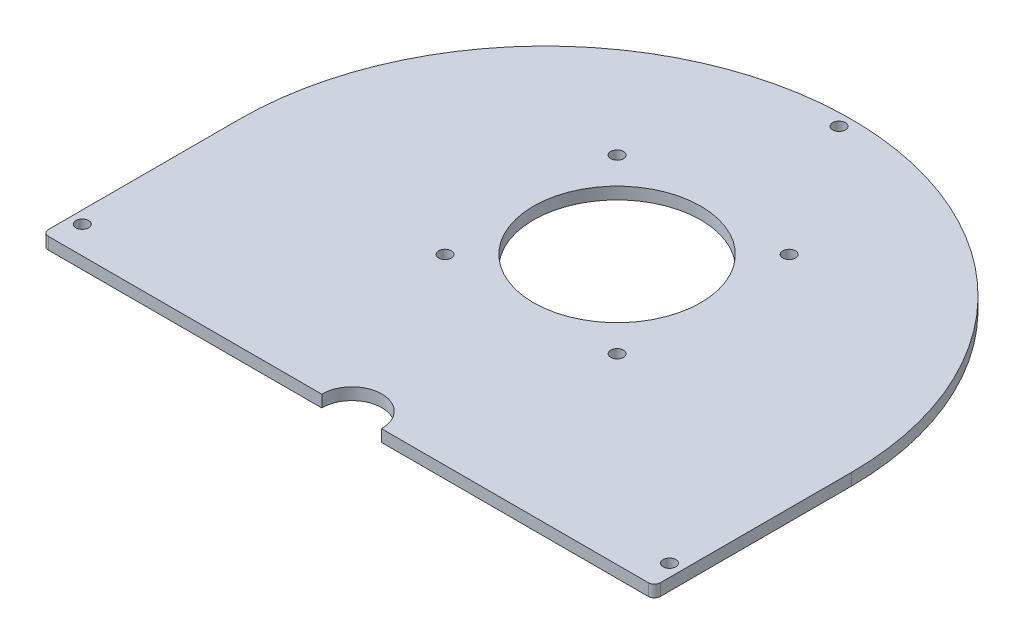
ISO-10303-21;
HEADER;
FILE_DESCRIPTION(('STEP AP214'),'2;1');
FILE_NAME('part.step','',(''),(''),'','','');
FILE_SCHEMA(('AUTOMOTIVE_DESIGN { 1 0 10303 214 1 1 1 1 }'));
ENDSEC;
DATA;
#1=APPLICATION_CONTEXT('core data for automotive mechanical design processes');
#2=APPLICATION_PROTOCOL_DEFINITION('international standard','automotive_design',2000,#1);
#3=PRODUCT_CONTEXT('',#1,'mechanical');
#4=PRODUCT('Part','Part','',(#3));
#5=PRODUCT_RELATED_PRODUCT_CATEGORY('part','',(#4));
#6=PRODUCT_DEFINITION_FORMATION('','',#4);
#7=PRODUCT_DEFINITION_CONTEXT('part definition',#1,'design');
#8=PRODUCT_DEFINITION('design','',#6,#7);
#9=PRODUCT_DEFINITION_SHAPE('','',#8);
#10=(LENGTH_UNIT() NAMED_UNIT(*) SI_UNIT(.MILLI.,.METRE.));
#11=(NAMED_UNIT(*) PLANE_ANGLE_UNIT() SI_UNIT($,.RADIAN.));
#12=(NAMED_UNIT(*) SI_UNIT($,.STERADIAN.) SOLID_ANGLE_UNIT());
#13=UNCERTAINTY_MEASURE_WITH_UNIT(LENGTH_MEASURE(1.E-05),#10,'distance_accuracy_value','');
#14=(GEOMETRIC_REPRESENTATION_CONTEXT(3) GLOBAL_UNCERTAINTY_ASSIGNED_CONTEXT((#13)) GLOBAL_UNIT_ASSIGNED_CONTEXT((#10,
#11,#12)) REPRESENTATION_CONTEXT('',''));
#15=CARTESIAN_POINT('',(0.,0.,0.));
#16=DIRECTION('',(0.,0.,1.));
#17=DIRECTION('',(1.,0.,0.));
#18=AXIS2_PLACEMENT_3D('',#15,#16,#17);
#19=CARTESIAN_POINT('',(-162.56,6.35,104.6734));
#20=DIRECTION('',(0.,0.,-1.));
#21=DIRECTION('',(-1.,0.,0.));
#22=AXIS2_PLACEMENT_3D('',#19,#20,#21);
#23=PLANE('',#22);
#24=DIRECTION('',(1.,0.,0.));
#25=VECTOR('',#24,1.);
#26=CARTESIAN_POINT('',(-162.56,0.,104.6734));
#27=LINE('',#26,#25);
#28=CARTESIAN_POINT('',(-159.385,0.,104.6734));
#29=VERTEX_POINT('',#28);
#30=CARTESIAN_POINT('',(-14.1612601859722,0.,104.6734));
#31=VERTEX_POINT('',#30);
#32=EDGE_CURVE('E118',#29,#31,#27,.T.);
#33=ORIENTED_EDGE('',*,*,#32,.T.);
#34=DIRECTION('',(0.,1.,0.));
#35=VECTOR('',#34,1.);
#36=CARTESIAN_POINT('',(-14.1612601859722,0.,104.6734));
#37=LINE('',#36,#35);
#38=CARTESIAN_POINT('',(-14.1612601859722,6.35,104.6734));
#39=VERTEX_POINT('',#38);
#40=EDGE_CURVE('E48',#31,#39,#37,.T.);
#41=ORIENTED_EDGE('',*,*,#40,.T.);
#42=DIRECTION('',(1.,0.,0.));
#43=VECTOR('',#42,1.);
#44=CARTESIAN_POINT('',(-162.56,6.35,104.6734));
#45=LINE('',#44,#43);
#46=CARTESIAN_POINT('',(-159.385,6.35,104.6734));
#47=VERTEX_POINT('',#46);
#48=EDGE_CURVE('E161',#47,#39,#45,.T.);
#49=ORIENTED_EDGE('',*,*,#48,.F.);
#50=DIRECTION('',(0.,-1.,0.));
#51=VECTOR('',#50,1.);
#52=CARTESIAN_POINT('',(-159.385,6.35,104.6734));
#53=LINE('',#52,#51);
#54=EDGE_CURVE('E143',#47,#29,#53,.T.);
#55=ORIENTED_EDGE('',*,*,#54,.T.);
#56=EDGE_LOOP('',(#33,#41,#49,#55));
#57=FACE_BOUND('',#56,.T.);
#58=ADVANCED_FACE('F33',(#57),#23,.F.);
#59=CARTESIAN_POINT('',(-162.56,6.35,104.6734));
#60=DIRECTION('',(1.,0.,0.));
#61=DIRECTION('',(0.,0.,-1.));
#62=AXIS2_PLACEMENT_3D('',#59,#60,#61);
#63=PLANE('',#62);
#64=DIRECTION('',(0.,0.,1.));
#65=VECTOR('',#64,1.);
#66=CARTESIAN_POINT('',(-162.56,0.,104.6734));
#67=LINE('',#66,#65);
#68=CARTESIAN_POINT('',(-162.56,0.,0.));
#69=VERTEX_POINT('',#68);
#70=CARTESIAN_POINT('',(-162.56,0.,101.4984));
#71=VERTEX_POINT('',#70);
#72=EDGE_CURVE('E119',#69,#71,#67,.T.);
#73=ORIENTED_EDGE('',*,*,#72,.T.);
#74=DIRECTION('',(0.,-1.,0.));
#75=VECTOR('',#74,1.);
#76=CARTESIAN_POINT('',(-162.56,6.35,101.4984));
#77=LINE('',#76,#75);
#78=CARTESIAN_POINT('',(-162.56,6.35,101.4984));
#79=VERTEX_POINT('',#78);
#80=EDGE_CURVE('E11',#71,#79,#77,.F.);
#81=ORIENTED_EDGE('',*,*,#80,.T.);
#82=DIRECTION('',(0.,0.,1.));
#83=VECTOR('',#82,1.);
#84=CARTESIAN_POINT('',(-162.56,6.35,104.6734));
#85=LINE('',#84,#83);
#86=CARTESIAN_POINT('',(-162.56,6.35,0.));
#87=VERTEX_POINT('',#86);
#88=EDGE_CURVE('E129',#87,#79,#85,.T.);
#89=ORIENTED_EDGE('',*,*,#88,.F.);
#90=DIRECTION('',(0.,-1.,0.));
#91=VECTOR('',#90,1.);
#92=CARTESIAN_POINT('',(-162.56,6.35,0.));
#93=LINE('',#92,#91);
#94=EDGE_CURVE('E130',#87,#69,#93,.T.);
#95=ORIENTED_EDGE('',*,*,#94,.T.);
#96=EDGE_LOOP('',(#73,#81,#89,#95));
#97=FACE_BOUND('',#96,.T.);
#98=ADVANCED_FACE('F177',(#97),#63,.F.);
#99=CARTESIAN_POINT('',(17.5862601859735,6.35,104.6734));
#100=VERTEX_POINT('',#99);
#101=CARTESIAN_POINT('',(159.385,6.35,104.6734));
#102=VERTEX_POINT('',#101);
#103=EDGE_CURVE('E112',#100,#102,#45,.T.);
#104=ORIENTED_EDGE('',*,*,#103,.F.);
#105=DIRECTION('',(0.,1.,0.));
#106=VECTOR('',#105,1.);
#107=CARTESIAN_POINT('',(17.5862601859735,0.,104.6734));
#108=LINE('',#107,#106);
#109=CARTESIAN_POINT('',(17.5862601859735,0.,104.6734));
#110=VERTEX_POINT('',#109);
#111=EDGE_CURVE('E98',#100,#110,#108,.F.);
#112=ORIENTED_EDGE('',*,*,#111,.T.);
#113=CARTESIAN_POINT('',(159.385,0.,104.6734));
#114=VERTEX_POINT('',#113);
#115=EDGE_CURVE('E110',#110,#114,#27,.T.);
#116=ORIENTED_EDGE('',*,*,#115,.T.);
#117=DIRECTION('',(0.,-1.,0.));
#118=VECTOR('',#117,1.);
#119=CARTESIAN_POINT('',(159.385,6.35,104.6734));
#120=LINE('',#119,#118);
#121=EDGE_CURVE('E146',#114,#102,#120,.F.);
#122=ORIENTED_EDGE('',*,*,#121,.T.);
#123=EDGE_LOOP('',(#104,#112,#116,#122));
#124=FACE_BOUND('',#123,.T.);
#125=ADVANCED_FACE('F108',(#124),#23,.F.);
#126=CARTESIAN_POINT('',(162.56,6.35,104.6734));
#127=DIRECTION('',(-1.,0.,0.));
#128=DIRECTION('',(0.,0.,1.));
#129=AXIS2_PLACEMENT_3D('',#126,#127,#128);
#130=PLANE('',#129);
#131=DIRECTION('',(0.,0.,-1.));
#132=VECTOR('',#131,1.);
#133=CARTESIAN_POINT('',(162.56,6.35,104.6734));
#134=LINE('',#133,#132);
#135=CARTESIAN_POINT('',(162.56,6.35,101.4984));
#136=VERTEX_POINT('',#135);
#137=CARTESIAN_POINT('',(162.56,6.35,0.));
#138=VERTEX_POINT('',#137);
#139=EDGE_CURVE('E154',#136,#138,#134,.T.);
#140=ORIENTED_EDGE('',*,*,#139,.F.);
#141=DIRECTION('',(0.,-1.,0.));
#142=VECTOR('',#141,1.);
#143=CARTESIAN_POINT('',(162.56,6.35,101.4984));
#144=LINE('',#143,#142);
#145=CARTESIAN_POINT('',(162.56,0.,101.4984));
#146=VERTEX_POINT('',#145);
#147=EDGE_CURVE('E137',#136,#146,#144,.T.);
#148=ORIENTED_EDGE('',*,*,#147,.T.);
#149=DIRECTION('',(0.,0.,-1.));
#150=VECTOR('',#149,1.);
#151=CARTESIAN_POINT('',(162.56,0.,104.6734));
#152=LINE('',#151,#150);
#153=CARTESIAN_POINT('',(162.56,0.,0.));
#154=VERTEX_POINT('',#153);
#155=EDGE_CURVE('E121',#146,#154,#152,.T.);
#156=ORIENTED_EDGE('',*,*,#155,.T.);
#157=DIRECTION('',(0.,-1.,0.));
#158=VECTOR('',#157,1.);
#159=CARTESIAN_POINT('',(162.56,6.35,0.));
#160=LINE('',#159,#158);
#161=EDGE_CURVE('E133',#138,#154,#160,.T.);
#162=ORIENTED_EDGE('',*,*,#161,.F.);
#163=EDGE_LOOP('',(#140,#148,#156,#162));
#164=FACE_BOUND('',#163,.T.);
#165=ADVANCED_FACE('F159',(#164),#130,.F.);
#166=CARTESIAN_POINT('',(0.,6.35,0.));
#167=DIRECTION('',(0.,-1.,0.));
#168=DIRECTION('',(0.,0.,-1.));
#169=AXIS2_PLACEMENT_3D('',#166,#167,#168);
#170=CYLINDRICAL_SURFACE('',#169,162.56);
#171=CARTESIAN_POINT('',(0.,0.,0.));
#172=DIRECTION('',(0.,1.,0.));
#173=DIRECTION('',(0.,0.,1.));
#174=AXIS2_PLACEMENT_3D('',#171,#172,#173);
#175=CIRCLE('',#174,162.56);
#176=EDGE_CURVE('E127',#154,#69,#175,.T.);
#177=ORIENTED_EDGE('',*,*,#176,.T.);
#178=ORIENTED_EDGE('',*,*,#94,.F.);
#179=CARTESIAN_POINT('',(0.,6.35,0.));
#180=DIRECTION('',(0.,1.,0.));
#181=DIRECTION('',(0.,0.,1.));
#182=AXIS2_PLACEMENT_3D('',#179,#180,#181);
#183=CIRCLE('',#182,162.56);
#184=EDGE_CURVE('E134',#138,#87,#183,.T.);
#185=ORIENTED_EDGE('',*,*,#184,.F.);
#186=ORIENTED_EDGE('',*,*,#161,.T.);
#187=EDGE_LOOP('',(#177,#178,#185,#186));
#188=FACE_BOUND('',#187,.T.);
#189=ADVANCED_FACE('F188',(#188),#170,.T.);
#190=CARTESIAN_POINT('',(0.,6.35,0.));
#191=DIRECTION('',(0.,1.,0.));
#192=DIRECTION('',(0.,0.,1.));
#193=AXIS2_PLACEMENT_3D('',#190,#191,#192);
#194=PLANE('',#193);
#195=CARTESIAN_POINT('',(1.71250000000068,6.35,104.474999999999));
#196=DIRECTION('',(0.,1.,0.));
#197=DIRECTION('',(0.,0.,1.));
#198=AXIS2_PLACEMENT_3D('',#195,#196,#197);
#199=CIRCLE('',#198,15.875000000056);
#200=EDGE_CURVE('E104',#100,#39,#199,.T.);
#201=ORIENTED_EDGE('',*,*,#200,.F.);
#202=ORIENTED_EDGE('',*,*,#103,.T.);
#203=CARTESIAN_POINT('',(159.385,6.35,101.4984));
#204=DIRECTION('',(0.,1.,0.));
#205=DIRECTION('',(0.,0.,1.));
#206=AXIS2_PLACEMENT_3D('',#203,#204,#205);
#207=CIRCLE('',#206,3.175);
#208=EDGE_CURVE('E41',#102,#136,#207,.T.);
#209=ORIENTED_EDGE('',*,*,#208,.T.);
#210=ORIENTED_EDGE('',*,*,#139,.T.);
#211=ORIENTED_EDGE('',*,*,#184,.T.);
#212=ORIENTED_EDGE('',*,*,#88,.T.);
#213=CARTESIAN_POINT('',(-159.385,6.35,101.4984));
#214=DIRECTION('',(0.,1.,0.));
#215=DIRECTION('',(0.,0.,1.));
#216=AXIS2_PLACEMENT_3D('',#213,#214,#215);
#217=CIRCLE('',#216,3.175);
#218=EDGE_CURVE('E148',#79,#47,#217,.T.);
#219=ORIENTED_EDGE('',*,*,#218,.T.);
#220=ORIENTED_EDGE('',*,*,#48,.T.);
#221=EDGE_LOOP('',(#201,#202,#209,#210,#211,#212,#219,#220));
#222=FACE_BOUND('',#221,.T.);
#223=CARTESIAN_POINT('',(45.72,6.35,-83.82));
#224=DIRECTION('',(0.,-1.,0.));
#225=DIRECTION('',(0.,0.,-1.));
#226=AXIS2_PLACEMENT_3D('',#223,#224,#225);
#227=CIRCLE('',#226,3.3782);
#228=CARTESIAN_POINT('',(45.72,6.35,-87.1982));
#229=VERTEX_POINT('',#228);
#230=EDGE_CURVE('E330',#229,#229,#227,.T.);
#231=ORIENTED_EDGE('',*,*,#230,.T.);
#232=EDGE_LOOP('',(#231));
#233=FACE_BOUND('',#232,.T.);
#234=CARTESIAN_POINT('',(-45.72,6.35,-83.82));
#235=DIRECTION('',(0.,-1.,0.));
#236=DIRECTION('',(0.,0.,-1.));
#237=AXIS2_PLACEMENT_3D('',#234,#235,#236);
#238=CIRCLE('',#237,3.3782);
#239=CARTESIAN_POINT('',(-45.72,6.35,-87.1982));
#240=VERTEX_POINT('',#239);
#241=EDGE_CURVE('E341',#240,#240,#238,.T.);
#242=ORIENTED_EDGE('',*,*,#241,.T.);
#243=EDGE_LOOP('',(#242));
#244=FACE_BOUND('',#243,.T.);
#245=CARTESIAN_POINT('',(-45.72,6.35,7.61999999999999));
#246=DIRECTION('',(0.,-1.,0.));
#247=DIRECTION('',(0.,0.,-1.));
#248=AXIS2_PLACEMENT_3D('',#245,#246,#247);
#249=CIRCLE('',#248,3.3782);
#250=CARTESIAN_POINT('',(-45.72,6.35,4.2418));
#251=VERTEX_POINT('',#250);
#252=EDGE_CURVE('E347',#251,#251,#249,.T.);
#253=ORIENTED_EDGE('',*,*,#252,.T.);
#254=EDGE_LOOP('',(#253));
#255=FACE_BOUND('',#254,.T.);
#256=CARTESIAN_POINT('',(45.72,6.35,7.61999999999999));
#257=DIRECTION('',(0.,-1.,0.));
#258=DIRECTION('',(0.,0.,-1.));
#259=AXIS2_PLACEMENT_3D('',#256,#257,#258);
#260=CIRCLE('',#259,3.3782);
#261=CARTESIAN_POINT('',(45.72,6.35,4.2418));
#262=VERTEX_POINT('',#261);
#263=EDGE_CURVE('E353',#262,#262,#260,.T.);
#264=ORIENTED_EDGE('',*,*,#263,.T.);
#265=EDGE_LOOP('',(#264));
#266=FACE_BOUND('',#265,.T.);
#267=CARTESIAN_POINT('',(0.,6.35,-38.1));
#268=DIRECTION('',(0.,1.,0.));
#269=DIRECTION('',(0.,0.,1.));
#270=AXIS2_PLACEMENT_3D('',#267,#268,#269);
#271=CIRCLE('',#270,44.45);
#272=CARTESIAN_POINT('',(0.,6.35,6.34999999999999));
#273=VERTEX_POINT('',#272);
#274=EDGE_CURVE('E356',#273,#273,#271,.T.);
#275=ORIENTED_EDGE('',*,*,#274,.F.);
#276=EDGE_LOOP('',(#275));
#277=FACE_BOUND('',#276,.T.);
#278=CARTESIAN_POINT('',(0.,6.35,-156.0068));
#279=DIRECTION('',(0.,1.,0.));
#280=DIRECTION('',(0.,0.,1.));
#281=AXIS2_PLACEMENT_3D('',#278,#279,#280);
#282=CIRCLE('',#281,3.37819999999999);
#283=CARTESIAN_POINT('',(0.,6.35,-152.6286));
#284=VERTEX_POINT('',#283);
#285=EDGE_CURVE('E360',#284,#284,#282,.T.);
#286=ORIENTED_EDGE('',*,*,#285,.F.);
#287=EDGE_LOOP('',(#286));
#288=FACE_BOUND('',#287,.T.);
#289=CARTESIAN_POINT('',(-156.0068,6.35,90.0684));
#290=DIRECTION('',(0.,1.,0.));
#291=DIRECTION('',(0.,0.,1.));
#292=AXIS2_PLACEMENT_3D('',#289,#290,#291);
#293=CIRCLE('',#292,3.3782);
#294=CARTESIAN_POINT('',(-156.0068,6.35,93.4466));
#295=VERTEX_POINT('',#294);
#296=EDGE_CURVE('E368',#295,#295,#293,.T.);
#297=ORIENTED_EDGE('',*,*,#296,.F.);
#298=EDGE_LOOP('',(#297));
#299=FACE_BOUND('',#298,.T.);
#300=CARTESIAN_POINT('',(156.0068,6.35,90.0684));
#301=DIRECTION('',(0.,1.,0.));
#302=DIRECTION('',(0.,0.,1.));
#303=AXIS2_PLACEMENT_3D('',#300,#301,#302);
#304=CIRCLE('',#303,3.3782);
#305=CARTESIAN_POINT('',(156.0068,6.35,93.4466));
#306=VERTEX_POINT('',#305);
#307=EDGE_CURVE('E374',#306,#306,#304,.T.);
#308=ORIENTED_EDGE('',*,*,#307,.F.);
#309=EDGE_LOOP('',(#308));
#310=FACE_BOUND('',#309,.T.);
#311=ADVANCED_FACE('F152',(#222,#233,#244,#255,#266,#277,#288,#299,#310),#194,.T.);
#312=CARTESIAN_POINT('',(0.,0.,0.));
#313=DIRECTION('',(0.,1.,0.));
#314=DIRECTION('',(0.,0.,1.));
#315=AXIS2_PLACEMENT_3D('',#312,#313,#314);
#316=PLANE('',#315);
#317=CARTESIAN_POINT('',(45.72,0.,-83.82));
#318=DIRECTION('',(0.,-1.,0.));
#319=DIRECTION('',(0.,0.,-1.));
#320=AXIS2_PLACEMENT_3D('',#317,#318,#319);
#321=CIRCLE('',#320,3.3782);
#322=CARTESIAN_POINT('',(45.72,0.,-87.1982));
#323=VERTEX_POINT('',#322);
#324=EDGE_CURVE('E333',#323,#323,#321,.T.);
#325=ORIENTED_EDGE('',*,*,#324,.F.);
#326=EDGE_LOOP('',(#325));
#327=FACE_BOUND('',#326,.T.);
#328=CARTESIAN_POINT('',(-45.72,0.,-83.82));
#329=DIRECTION('',(0.,-1.,0.));
#330=DIRECTION('',(0.,0.,-1.));
#331=AXIS2_PLACEMENT_3D('',#328,#329,#330);
#332=CIRCLE('',#331,3.3782);
#333=CARTESIAN_POINT('',(-45.72,0.,-87.1982));
#334=VERTEX_POINT('',#333);
#335=EDGE_CURVE('E335',#334,#334,#332,.T.);
#336=ORIENTED_EDGE('',*,*,#335,.F.);
#337=EDGE_LOOP('',(#336));
#338=FACE_BOUND('',#337,.T.);
#339=CARTESIAN_POINT('',(-45.72,0.,7.61999999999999));
#340=DIRECTION('',(0.,-1.,0.));
#341=DIRECTION('',(0.,0.,-1.));
#342=AXIS2_PLACEMENT_3D('',#339,#340,#341);
#343=CIRCLE('',#342,3.3782);
#344=CARTESIAN_POINT('',(-45.72,0.,4.2418));
#345=VERTEX_POINT('',#344);
#346=EDGE_CURVE('E344',#345,#345,#343,.T.);
#347=ORIENTED_EDGE('',*,*,#346,.F.);
#348=EDGE_LOOP('',(#347));
#349=FACE_BOUND('',#348,.T.);
#350=CARTESIAN_POINT('',(45.72,0.,7.61999999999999));
#351=DIRECTION('',(0.,-1.,0.));
#352=DIRECTION('',(0.,0.,-1.));
#353=AXIS2_PLACEMENT_3D('',#350,#351,#352);
#354=CIRCLE('',#353,3.3782);
#355=CARTESIAN_POINT('',(45.72,0.,4.2418));
#356=VERTEX_POINT('',#355);
#357=EDGE_CURVE('E350',#356,#356,#354,.T.);
#358=ORIENTED_EDGE('',*,*,#357,.F.);
#359=EDGE_LOOP('',(#358));
#360=FACE_BOUND('',#359,.T.);
#361=CARTESIAN_POINT('',(0.,0.,-38.1));
#362=DIRECTION('',(0.,1.,0.));
#363=DIRECTION('',(0.,0.,1.));
#364=AXIS2_PLACEMENT_3D('',#361,#362,#363);
#365=CIRCLE('',#364,44.45);
#366=CARTESIAN_POINT('',(0.,0.,6.34999999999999));
#367=VERTEX_POINT('',#366);
#368=EDGE_CURVE('E357',#367,#367,#365,.T.);
#369=ORIENTED_EDGE('',*,*,#368,.T.);
#370=EDGE_LOOP('',(#369));
#371=FACE_BOUND('',#370,.T.);
#372=CARTESIAN_POINT('',(0.,0.,-156.0068));
#373=DIRECTION('',(0.,1.,0.));
#374=DIRECTION('',(0.,0.,1.));
#375=AXIS2_PLACEMENT_3D('',#372,#373,#374);
#376=CIRCLE('',#375,3.3782);
#377=CARTESIAN_POINT('',(0.,0.,-152.6286));
#378=VERTEX_POINT('',#377);
#379=EDGE_CURVE('E365',#378,#378,#376,.T.);
#380=ORIENTED_EDGE('',*,*,#379,.T.);
#381=EDGE_LOOP('',(#380));
#382=FACE_BOUND('',#381,.T.);
#383=CARTESIAN_POINT('',(-156.0068,0.,90.0684));
#384=DIRECTION('',(0.,1.,0.));
#385=DIRECTION('',(0.,0.,1.));
#386=AXIS2_PLACEMENT_3D('',#383,#384,#385);
#387=CIRCLE('',#386,3.3782);
#388=CARTESIAN_POINT('',(-156.0068,0.,93.4466));
#389=VERTEX_POINT('',#388);
#390=EDGE_CURVE('E371',#389,#389,#387,.T.);
#391=ORIENTED_EDGE('',*,*,#390,.T.);
#392=EDGE_LOOP('',(#391));
#393=FACE_BOUND('',#392,.T.);
#394=CARTESIAN_POINT('',(156.0068,0.,90.0684));
#395=DIRECTION('',(0.,1.,0.));
#396=DIRECTION('',(0.,0.,1.));
#397=AXIS2_PLACEMENT_3D('',#394,#395,#396);
#398=CIRCLE('',#397,3.3782);
#399=CARTESIAN_POINT('',(156.0068,0.,93.4466));
#400=VERTEX_POINT('',#399);
#401=EDGE_CURVE('E122',#400,#400,#398,.T.);
#402=ORIENTED_EDGE('',*,*,#401,.T.);
#403=EDGE_LOOP('',(#402));
#404=FACE_BOUND('',#403,.T.);
#405=ORIENTED_EDGE('',*,*,#115,.F.);
#406=CARTESIAN_POINT('',(1.71250000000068,0.,104.474999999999));
#407=DIRECTION('',(0.,1.,0.));
#408=DIRECTION('',(0.,0.,1.));
#409=AXIS2_PLACEMENT_3D('',#406,#407,#408);
#410=CIRCLE('',#409,15.875000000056);
#411=EDGE_CURVE('E95',#110,#31,#410,.T.);
#412=ORIENTED_EDGE('',*,*,#411,.T.);
#413=ORIENTED_EDGE('',*,*,#32,.F.);
#414=CARTESIAN_POINT('',(-159.385,0.,101.4984));
#415=DIRECTION('',(0.,1.,0.));
#416=DIRECTION('',(0.,0.,1.));
#417=AXIS2_PLACEMENT_3D('',#414,#415,#416);
#418=CIRCLE('',#417,3.175);
#419=EDGE_CURVE('E140',#29,#71,#418,.F.);
#420=ORIENTED_EDGE('',*,*,#419,.T.);
#421=ORIENTED_EDGE('',*,*,#72,.F.);
#422=ORIENTED_EDGE('',*,*,#176,.F.);
#423=ORIENTED_EDGE('',*,*,#155,.F.);
#424=CARTESIAN_POINT('',(159.385,0.,101.4984));
#425=DIRECTION('',(0.,1.,0.));
#426=DIRECTION('',(0.,0.,1.));
#427=AXIS2_PLACEMENT_3D('',#424,#425,#426);
#428=CIRCLE('',#427,3.175);
#429=EDGE_CURVE('E116',#146,#114,#428,.F.);
#430=ORIENTED_EDGE('',*,*,#429,.T.);
#431=EDGE_LOOP('',(#405,#412,#413,#420,#421,#422,#423,#430));
#432=FACE_BOUND('',#431,.T.);
#433=ADVANCED_FACE('F114',(#327,#338,#349,#360,#371,#382,#393,#404,#432),#316,.F.);
#434=CARTESIAN_POINT('',(156.0068,6.35,90.0684));
#435=DIRECTION('',(0.,1.,0.));
#436=DIRECTION('',(0.,0.,1.));
#437=AXIS2_PLACEMENT_3D('',#434,#435,#436);
#438=CYLINDRICAL_SURFACE('',#437,3.3782);
#439=ORIENTED_EDGE('',*,*,#401,.F.);
#440=EDGE_LOOP('',(#439));
#441=FACE_BOUND('',#440,.T.);
#442=ORIENTED_EDGE('',*,*,#307,.T.);
#443=EDGE_LOOP('',(#442));
#444=FACE_BOUND('',#443,.T.);
#445=ADVANCED_FACE('F197',(#441,#444),#438,.F.);
#446=CARTESIAN_POINT('',(-156.0068,6.35,90.0684));
#447=DIRECTION('',(0.,1.,0.));
#448=DIRECTION('',(0.,0.,1.));
#449=AXIS2_PLACEMENT_3D('',#446,#447,#448);
#450=CYLINDRICAL_SURFACE('',#449,3.3782);
#451=ORIENTED_EDGE('',*,*,#390,.F.);
#452=EDGE_LOOP('',(#451));
#453=FACE_BOUND('',#452,.T.);
#454=ORIENTED_EDGE('',*,*,#296,.T.);
#455=EDGE_LOOP('',(#454));
#456=FACE_BOUND('',#455,.T.);
#457=ADVANCED_FACE('F203',(#453,#456),#450,.F.);
#458=CARTESIAN_POINT('',(0.,6.35,-156.0068));
#459=DIRECTION('',(0.,1.,0.));
#460=DIRECTION('',(0.,0.,1.));
#461=AXIS2_PLACEMENT_3D('',#458,#459,#460);
#462=CYLINDRICAL_SURFACE('',#461,3.37819999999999);
#463=ORIENTED_EDGE('',*,*,#379,.F.);
#464=EDGE_LOOP('',(#463));
#465=FACE_BOUND('',#464,.T.);
#466=ORIENTED_EDGE('',*,*,#285,.T.);
#467=EDGE_LOOP('',(#466));
#468=FACE_BOUND('',#467,.T.);
#469=ADVANCED_FACE('F172',(#465,#468),#462,.F.);
#470=CARTESIAN_POINT('',(0.,0.,-38.1));
#471=DIRECTION('',(0.,1.,0.));
#472=DIRECTION('',(0.,0.,1.));
#473=AXIS2_PLACEMENT_3D('',#470,#471,#472);
#474=CYLINDRICAL_SURFACE('',#473,44.45);
#475=ORIENTED_EDGE('',*,*,#368,.F.);
#476=EDGE_LOOP('',(#475));
#477=FACE_BOUND('',#476,.T.);
#478=ORIENTED_EDGE('',*,*,#274,.T.);
#479=EDGE_LOOP('',(#478));
#480=FACE_BOUND('',#479,.T.);
#481=ADVANCED_FACE('F165',(#477,#480),#474,.F.);
#482=CARTESIAN_POINT('',(159.385,6.35,101.4984));
#483=DIRECTION('',(0.,-1.,0.));
#484=DIRECTION('',(0.,0.,-1.));
#485=AXIS2_PLACEMENT_3D('',#482,#483,#484);
#486=CYLINDRICAL_SURFACE('',#485,3.175);
#487=ORIENTED_EDGE('',*,*,#208,.F.);
#488=ORIENTED_EDGE('',*,*,#121,.F.);
#489=ORIENTED_EDGE('',*,*,#429,.F.);
#490=ORIENTED_EDGE('',*,*,#147,.F.);
#491=EDGE_LOOP('',(#487,#488,#489,#490));
#492=FACE_BOUND('',#491,.T.);
#493=ADVANCED_FACE('F163',(#492),#486,.T.);
#494=CARTESIAN_POINT('',(-159.385,6.35,101.4984));
#495=DIRECTION('',(0.,-1.,0.));
#496=DIRECTION('',(0.,0.,-1.));
#497=AXIS2_PLACEMENT_3D('',#494,#495,#496);
#498=CYLINDRICAL_SURFACE('',#497,3.175);
#499=ORIENTED_EDGE('',*,*,#218,.F.);
#500=ORIENTED_EDGE('',*,*,#80,.F.);
#501=ORIENTED_EDGE('',*,*,#419,.F.);
#502=ORIENTED_EDGE('',*,*,#54,.F.);
#503=EDGE_LOOP('',(#499,#500,#501,#502));
#504=FACE_BOUND('',#503,.T.);
#505=ADVANCED_FACE('F35',(#504),#498,.T.);
#506=CARTESIAN_POINT('',(45.72,0.,7.61999999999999));
#507=DIRECTION('',(0.,-1.,0.));
#508=DIRECTION('',(0.,0.,-1.));
#509=AXIS2_PLACEMENT_3D('',#506,#507,#508);
#510=CYLINDRICAL_SURFACE('',#509,3.3782);
#511=ORIENTED_EDGE('',*,*,#263,.F.);
#512=EDGE_LOOP('',(#511));
#513=FACE_BOUND('',#512,.T.);
#514=ORIENTED_EDGE('',*,*,#357,.T.);
#515=EDGE_LOOP('',(#514));
#516=FACE_BOUND('',#515,.T.);
#517=ADVANCED_FACE('F170',(#513,#516),#510,.F.);
#518=CARTESIAN_POINT('',(-45.72,0.,7.61999999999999));
#519=DIRECTION('',(0.,-1.,0.));
#520=DIRECTION('',(0.,0.,-1.));
#521=AXIS2_PLACEMENT_3D('',#518,#519,#520);
#522=CYLINDRICAL_SURFACE('',#521,3.3782);
#523=ORIENTED_EDGE('',*,*,#252,.F.);
#524=EDGE_LOOP('',(#523));
#525=FACE_BOUND('',#524,.T.);
#526=ORIENTED_EDGE('',*,*,#346,.T.);
#527=EDGE_LOOP('',(#526));
#528=FACE_BOUND('',#527,.T.);
#529=ADVANCED_FACE('F213',(#525,#528),#522,.F.);
#530=CARTESIAN_POINT('',(-45.72,0.,-83.82));
#531=DIRECTION('',(0.,-1.,0.));
#532=DIRECTION('',(0.,0.,-1.));
#533=AXIS2_PLACEMENT_3D('',#530,#531,#532);
#534=CYLINDRICAL_SURFACE('',#533,3.3782);
#535=ORIENTED_EDGE('',*,*,#241,.F.);
#536=EDGE_LOOP('',(#535));
#537=FACE_BOUND('',#536,.T.);
#538=ORIENTED_EDGE('',*,*,#335,.T.);
#539=EDGE_LOOP('',(#538));
#540=FACE_BOUND('',#539,.T.);
#541=ADVANCED_FACE('F217',(#537,#540),#534,.F.);
#542=CARTESIAN_POINT('',(45.72,0.,-83.82));
#543=DIRECTION('',(0.,-1.,0.));
#544=DIRECTION('',(0.,0.,-1.));
#545=AXIS2_PLACEMENT_3D('',#542,#543,#544);
#546=CYLINDRICAL_SURFACE('',#545,3.3782);
#547=ORIENTED_EDGE('',*,*,#230,.F.);
#548=EDGE_LOOP('',(#547));
#549=FACE_BOUND('',#548,.T.);
#550=ORIENTED_EDGE('',*,*,#324,.T.);
#551=EDGE_LOOP('',(#550));
#552=FACE_BOUND('',#551,.T.);
#553=ADVANCED_FACE('F221',(#549,#552),#546,.F.);
#554=CARTESIAN_POINT('',(1.71250000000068,0.,104.474999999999));
#555=DIRECTION('',(0.,1.,0.));
#556=DIRECTION('',(0.,0.,1.));
#557=AXIS2_PLACEMENT_3D('',#554,#555,#556);
#558=CYLINDRICAL_SURFACE('',#557,15.875000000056);
#559=ORIENTED_EDGE('',*,*,#411,.F.);
#560=ORIENTED_EDGE('',*,*,#111,.F.);
#561=ORIENTED_EDGE('',*,*,#200,.T.);
#562=ORIENTED_EDGE('',*,*,#40,.F.);
#563=EDGE_LOOP('',(#559,#560,#561,#562));
#564=FACE_BOUND('',#563,.T.);
#565=ADVANCED_FACE('F97',(#564),#558,.F.);
#566=CLOSED_SHELL('',(#58,#98,#125,#165,#189,#311,#433,#445,#457,#469,#481,#493,#505,#517,#529,
#541,#553,#565));
#567=MANIFOLD_SOLID_BREP('B2',#566);
#568=ADVANCED_BREP_SHAPE_REPRESENTATION('',(#18,#567),#14);
#569=SHAPE_DEFINITION_REPRESENTATION(#9,#568);
ENDSEC;
END-ISO-10303-21;
